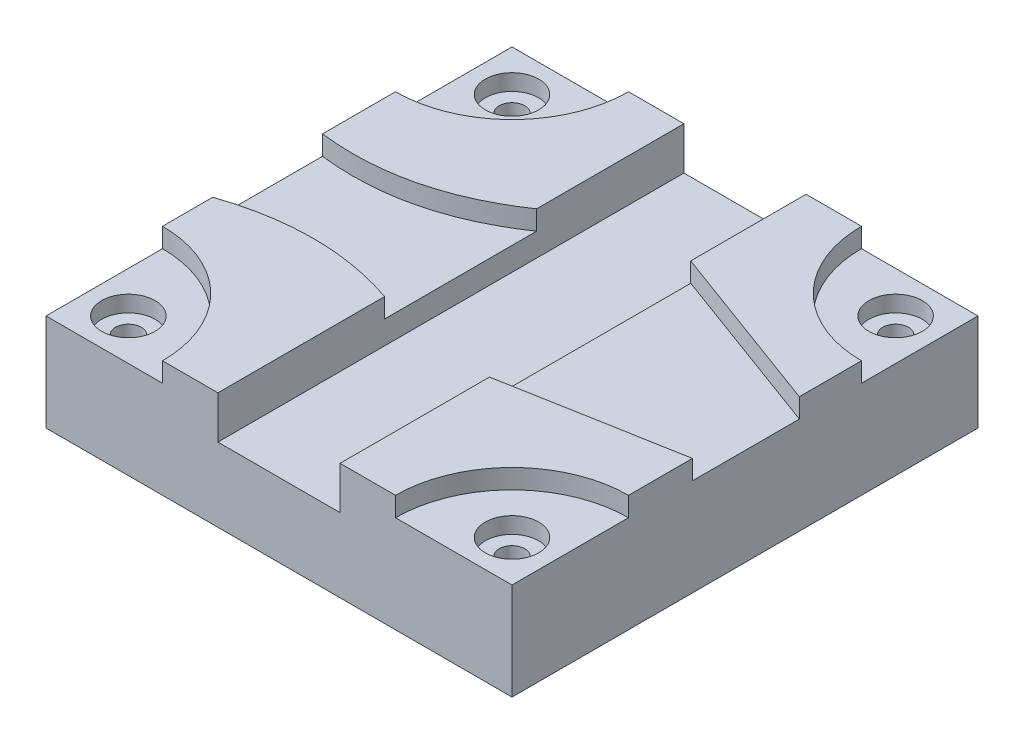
from build123d import *

# Parameters (mm, degrees)
SKETCH1_W                               = 56.222669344
SKETCH1_H                               = 59.327878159
BOSS_EXTRUDE1_DEPTH                     = 31.75
BOSS_EXTRUDE2_DEPTH                     = 6.35
SKETCH3_W                               = 56.222669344
SKETCH3_H                               = 31.75
BOSS_EXTRUDE3_DEPTH                     = 93.072121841
SKETCH4_W                               = 152.4
SKETCH4_H                               = 38.1
BOSS_EXTRUDE4_DEPTH                     = 96.177330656
SKETCH5_W                               = 152.4
SKETCH5_H                               = 13.97
CUT_EXTRUDE1_DEPTH                      = 39.954661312
BOSS_EXTRUDE5_DEPTH                     = 6.35
SKETCH7_W                               = 65.807244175
SKETCH7_H                               = 6.35
CUT_EXTRUDE2_DEPTH                      = 129.48396386
DRAFT1_ANGLE                            = 10.242373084
DRAFT2_ANGLE                            = 20.201855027
M72_CLEARANCE_HOLE1_D                   = 76.2
M72_CLEARANCE_HOLE1_DEPTH               = 6.35
CBORE_FOR_M8_HEX_HEAD_BOLT1_D           = 8.4328
CBORE_FOR_M8_HEX_HEAD_BOLT1_CBORE_D     = 17.4625
CBORE_FOR_M8_HEX_HEAD_BOLT1_CBORE_DEPTH = 5.3086


with BuildPart() as part:
    # Sketch1 → Boss-Extrude1 (new body)
    with BuildSketch(Plane.XZ.offset(38.1)):
        with Locations((-48.088665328, 46.536060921)):
            Rectangle(SKETCH1_W, SKETCH1_H)
    extrude(amount=-BOSS_EXTRUDE1_DEPTH)

    # Sketch2 → Boss-Extrude2 (add)
    with BuildSketch(Plane(origin=(0, -6.35, 0), x_dir=(-1, 0, 0), z_dir=(0, 1, 0))):
        with BuildLine():
            Line((19.977330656, 76.2), (76.200000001, 76.2))
            Line((76.200000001, 76.2), (76.200000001, 21.675909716))
            add(Edge.make_bspline(
                [(76.200000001, 21.675909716), (48.133802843, 12.059048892), (19.977330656, 21.694479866)],
                knots=[0.129133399, 0.129133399, 0.129133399, 0.772050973, 0.772050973, 0.772050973], degree=2))
            Line((19.977330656, 21.694479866), (19.977330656, 76.2))
        make_face()
    extrude(amount=BOSS_EXTRUDE2_DEPTH)

    # Sketch3 → Boss-Extrude3 (add)
    with BuildSketch(Plane(origin=(0, 0, 16.872121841), x_dir=(-1, 0, 0), z_dir=(0, 0, -1))):
        with Locations((48.088665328, -22.225)):
            Rectangle(SKETCH3_W, SKETCH3_H)
    extrude(amount=BOSS_EXTRUDE3_DEPTH)

    # Sketch4 → Boss-Extrude4 (add)
    with BuildSketch(Plane(origin=(-19.977330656, 0, 0), x_dir=(0, 0, -1), z_dir=(1, 0, 0))):
        with Locations((0, -19.05)):
            Rectangle(SKETCH4_W, SKETCH4_H)
    extrude(amount=BOSS_EXTRUDE4_DEPTH)

    # Sketch5 → Cut-Extrude1 (cut)
    with BuildSketch(Plane.ZY.offset(19.977330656)):
        with Locations((0, -6.985)):
            Rectangle(SKETCH5_W, SKETCH5_H)
    extrude(amount=-CUT_EXTRUDE1_DEPTH, mode=Mode.SUBTRACT)

    # Sketch6 → Boss-Extrude5 (add)
    with BuildSketch(Plane(origin=(0, -6.35, 0), x_dir=(-1, 0, 0), z_dir=(0, 1, 0))):
        with BuildLine():
            Line((76.200000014, -14.226023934), (76.200000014, -76.2))
            Line((76.200000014, -76.2), (19.977330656, -76.2))
            Line((19.977330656, -76.2), (19.977330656, -28.025336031))
            add(Edge.make_bspline(
                [(19.977330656, -28.025336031), (45.545136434, -10.499293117), (76.200000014, -14.226023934)],
                knots=[0.251643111, 0.251643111, 0.251643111, 0.869678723, 0.869678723, 0.869678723], degree=2))
        make_face()
    extrude(amount=BOSS_EXTRUDE5_DEPTH)

    # Sketch7 → Cut-Extrude2 (cut, through all)
    with BuildSketch(Plane.ZY.offset(-19.977330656)):
        with Locations((-5.566145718, -3.175)):
            Rectangle(SKETCH7_W, SKETCH7_H)
    extrude(amount=-CUT_EXTRUDE2_DEPTH, mode=Mode.SUBTRACT)

    # Draft1
    draft1_faces = [part.faces().sort_by_distance(p)[0] for p in [
        (48.088665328, -3.175, 27.337476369),
    ]]
    draft(draft1_faces, Plane(origin=(19.977330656, 0, 0), x_dir=(0, 0, -1), z_dir=(-1, 0, 0)), DRAFT1_ANGLE)

    # Draft2
    draft2_faces = [part.faces().sort_by_distance(p)[0] for p in [
        (48.088665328, -3.175, -38.469767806),
    ]]
    draft(draft2_faces, Plane(origin=(19.977330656, 0, 0), x_dir=(0, 0, -1), z_dir=(-1, 0, 0)), DRAFT2_ANGLE)

    # M72 Clearance Hole1
    with Locations(Plane(origin=(0, 0, 0), x_dir=(1, 0, 0), z_dir=(0, 1, 0))):
        with Locations((-76.2, 76.2), (76.2, 76.2), (76.2, -76.2), (-76.2, -76.2)):
            Hole(M72_CLEARANCE_HOLE1_D / 2, depth=M72_CLEARANCE_HOLE1_DEPTH)

    # CBORE for M8 Hex Head Bolt1 (through all)
    with Locations(Plane(origin=(0, -6.35, 0), x_dir=(1, 0, 0), z_dir=(0, 1, 0))):
        with Locations((-62.729615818, 62.729615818), (62.729615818, 62.729615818), (62.729615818, -62.729615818), (-62.729615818, -62.729615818)):
            CounterBoreHole(CBORE_FOR_M8_HEX_HEAD_BOLT1_D / 2, CBORE_FOR_M8_HEX_HEAD_BOLT1_CBORE_D / 2, CBORE_FOR_M8_HEX_HEAD_BOLT1_CBORE_DEPTH)


solid = part.part
